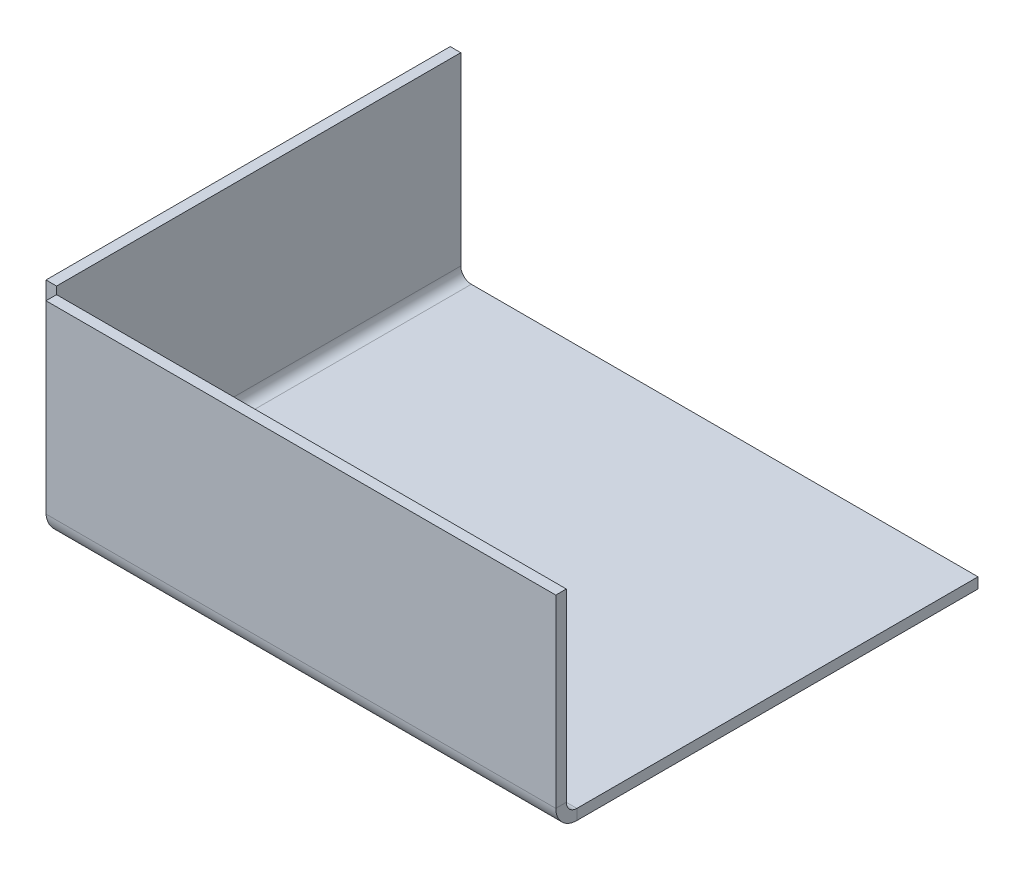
ISO-10303-21;
HEADER;
FILE_DESCRIPTION(('STEP AP214'),'2;1');
FILE_NAME('part.step','',(''),(''),'','','');
FILE_SCHEMA(('AUTOMOTIVE_DESIGN { 1 0 10303 214 1 1 1 1 }'));
ENDSEC;
DATA;
#1=APPLICATION_CONTEXT('core data for automotive mechanical design processes');
#2=APPLICATION_PROTOCOL_DEFINITION('international standard','automotive_design',2000,#1);
#3=PRODUCT_CONTEXT('',#1,'mechanical');
#4=PRODUCT('Part','Part','',(#3));
#5=PRODUCT_RELATED_PRODUCT_CATEGORY('part','',(#4));
#6=PRODUCT_DEFINITION_FORMATION('','',#4);
#7=PRODUCT_DEFINITION_CONTEXT('part definition',#1,'design');
#8=PRODUCT_DEFINITION('design','',#6,#7);
#9=PRODUCT_DEFINITION_SHAPE('','',#8);
#10=(LENGTH_UNIT() NAMED_UNIT(*) SI_UNIT(.MILLI.,.METRE.));
#11=(NAMED_UNIT(*) PLANE_ANGLE_UNIT() SI_UNIT($,.RADIAN.));
#12=(NAMED_UNIT(*) SI_UNIT($,.STERADIAN.) SOLID_ANGLE_UNIT());
#13=UNCERTAINTY_MEASURE_WITH_UNIT(LENGTH_MEASURE(1.E-05),#10,'distance_accuracy_value','');
#14=(GEOMETRIC_REPRESENTATION_CONTEXT(3) GLOBAL_UNCERTAINTY_ASSIGNED_CONTEXT((#13)) GLOBAL_UNIT_ASSIGNED_CONTEXT((#10,
#11,#12)) REPRESENTATION_CONTEXT('',''));
#15=CARTESIAN_POINT('',(0.,0.,0.));
#16=DIRECTION('',(0.,0.,1.));
#17=DIRECTION('',(1.,0.,0.));
#18=AXIS2_PLACEMENT_3D('',#15,#16,#17);
#19=CARTESIAN_POINT('',(0.,-2.,0.));
#20=DIRECTION('',(0.,-1.,0.));
#21=DIRECTION('',(0.,0.,-1.));
#22=AXIS2_PLACEMENT_3D('',#19,#20,#21);
#23=PLANE('',#22);
#24=DIRECTION('',(0.,0.,-1.));
#25=VECTOR('',#24,1.);
#26=CARTESIAN_POINT('',(50.,-2.,-40.));
#27=LINE('',#26,#25);
#28=CARTESIAN_POINT('',(50.,-2.00000000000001,36.));
#29=VERTEX_POINT('',#28);
#30=CARTESIAN_POINT('',(50.,-2.,-40.));
#31=VERTEX_POINT('',#30);
#32=EDGE_CURVE('E102',#29,#31,#27,.T.);
#33=ORIENTED_EDGE('',*,*,#32,.F.);
#34=DIRECTION('',(1.,0.,0.));
#35=VECTOR('',#34,1.);
#36=CARTESIAN_POINT('',(50.,-2.00000000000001,36.));
#37=LINE('',#36,#35);
#38=CARTESIAN_POINT('',(-46.,-2.,36.));
#39=VERTEX_POINT('',#38);
#40=EDGE_CURVE('E215',#29,#39,#37,.F.);
#41=ORIENTED_EDGE('',*,*,#40,.T.);
#42=DIRECTION('',(0.,0.,1.));
#43=VECTOR('',#42,1.);
#44=CARTESIAN_POINT('',(-46.,-2.,36.5857864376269));
#45=LINE('',#44,#43);
#46=CARTESIAN_POINT('',(-46.,-2.,-40.));
#47=VERTEX_POINT('',#46);
#48=EDGE_CURVE('E312',#39,#47,#45,.F.);
#49=ORIENTED_EDGE('',*,*,#48,.T.);
#50=DIRECTION('',(-1.,0.,0.));
#51=VECTOR('',#50,1.);
#52=CARTESIAN_POINT('',(50.,-2.,-40.));
#53=LINE('',#52,#51);
#54=EDGE_CURVE('E87',#31,#47,#53,.T.);
#55=ORIENTED_EDGE('',*,*,#54,.F.);
#56=EDGE_LOOP('',(#33,#41,#49,#55));
#57=FACE_BOUND('',#56,.T.);
#58=ADVANCED_FACE('F79',(#57),#23,.T.);
#59=CARTESIAN_POINT('',(0.,0.,0.));
#60=DIRECTION('',(0.,-1.,0.));
#61=DIRECTION('',(0.,0.,-1.));
#62=AXIS2_PLACEMENT_3D('',#59,#60,#61);
#63=PLANE('',#62);
#64=DIRECTION('',(1.,0.,0.));
#65=VECTOR('',#64,1.);
#66=CARTESIAN_POINT('',(50.,0.,36.));
#67=LINE('',#66,#65);
#68=CARTESIAN_POINT('',(50.,0.,36.));
#69=VERTEX_POINT('',#68);
#70=CARTESIAN_POINT('',(-46.,0.,36.));
#71=VERTEX_POINT('',#70);
#72=EDGE_CURVE('E220',#69,#71,#67,.F.);
#73=ORIENTED_EDGE('',*,*,#72,.F.);
#74=DIRECTION('',(0.,0.,-1.));
#75=VECTOR('',#74,1.);
#76=CARTESIAN_POINT('',(50.,0.,-40.));
#77=LINE('',#76,#75);
#78=CARTESIAN_POINT('',(50.,0.,-40.));
#79=VERTEX_POINT('',#78);
#80=EDGE_CURVE('E295',#69,#79,#77,.T.);
#81=ORIENTED_EDGE('',*,*,#80,.T.);
#82=DIRECTION('',(-1.,0.,0.));
#83=VECTOR('',#82,1.);
#84=CARTESIAN_POINT('',(50.,0.,-40.));
#85=LINE('',#84,#83);
#86=CARTESIAN_POINT('',(-46.,0.,-40.));
#87=VERTEX_POINT('',#86);
#88=EDGE_CURVE('E291',#79,#87,#85,.T.);
#89=ORIENTED_EDGE('',*,*,#88,.T.);
#90=DIRECTION('',(0.,0.,1.));
#91=VECTOR('',#90,1.);
#92=CARTESIAN_POINT('',(-46.,0.,36.5857864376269));
#93=LINE('',#92,#91);
#94=EDGE_CURVE('E302',#71,#87,#93,.F.);
#95=ORIENTED_EDGE('',*,*,#94,.F.);
#96=EDGE_LOOP('',(#73,#81,#89,#95));
#97=FACE_BOUND('',#96,.T.);
#98=ADVANCED_FACE('F263',(#97),#63,.F.);
#99=CARTESIAN_POINT('',(50.,-2.,-40.));
#100=DIRECTION('',(1.,0.,0.));
#101=DIRECTION('',(0.,0.,-1.));
#102=AXIS2_PLACEMENT_3D('',#99,#100,#101);
#103=PLANE('',#102);
#104=ORIENTED_EDGE('',*,*,#80,.F.);
#105=DIRECTION('',(0.,-1.,0.));
#106=VECTOR('',#105,1.);
#107=CARTESIAN_POINT('',(50.,0.,36.));
#108=LINE('',#107,#106);
#109=EDGE_CURVE('E225',#69,#29,#108,.T.);
#110=ORIENTED_EDGE('',*,*,#109,.T.);
#111=ORIENTED_EDGE('',*,*,#32,.T.);
#112=DIRECTION('',(0.,1.,0.));
#113=VECTOR('',#112,1.);
#114=CARTESIAN_POINT('',(50.,-2.,-40.));
#115=LINE('',#114,#113);
#116=EDGE_CURVE('E13',#31,#79,#115,.T.);
#117=ORIENTED_EDGE('',*,*,#116,.T.);
#118=EDGE_LOOP('',(#104,#110,#111,#117));
#119=FACE_BOUND('',#118,.T.);
#120=ADVANCED_FACE('F81',(#119),#103,.T.);
#121=CARTESIAN_POINT('',(50.,-2.,-40.));
#122=DIRECTION('',(0.,0.,-1.));
#123=DIRECTION('',(-1.,0.,0.));
#124=AXIS2_PLACEMENT_3D('',#121,#122,#123);
#125=PLANE('',#124);
#126=DIRECTION('',(0.,-1.,0.));
#127=VECTOR('',#126,1.);
#128=CARTESIAN_POINT('',(-46.,0.,-40.));
#129=LINE('',#128,#127);
#130=EDGE_CURVE('E289',#87,#47,#129,.T.);
#131=ORIENTED_EDGE('',*,*,#130,.F.);
#132=ORIENTED_EDGE('',*,*,#88,.F.);
#133=ORIENTED_EDGE('',*,*,#116,.F.);
#134=ORIENTED_EDGE('',*,*,#54,.T.);
#135=EDGE_LOOP('',(#131,#132,#133,#134));
#136=FACE_BOUND('',#135,.T.);
#137=ADVANCED_FACE('F277',(#136),#125,.T.);
#138=CARTESIAN_POINT('',(-46.,2.,-40.));
#139=DIRECTION('',(0.,0.,-1.));
#140=DIRECTION('',(-1.,0.,0.));
#141=AXIS2_PLACEMENT_3D('',#138,#139,#140);
#142=PLANE('',#141);
#143=DIRECTION('',(-1.,0.,0.));
#144=VECTOR('',#143,1.);
#145=CARTESIAN_POINT('',(-50.,1.99999999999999,-40.));
#146=LINE('',#145,#144);
#147=CARTESIAN_POINT('',(-48.,1.99999999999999,-40.));
#148=VERTEX_POINT('',#147);
#149=CARTESIAN_POINT('',(-50.,1.99999999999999,-40.));
#150=VERTEX_POINT('',#149);
#151=EDGE_CURVE('E342',#148,#150,#146,.T.);
#152=ORIENTED_EDGE('',*,*,#151,.F.);
#153=CARTESIAN_POINT('',(-46.,2.,-40.));
#154=DIRECTION('',(0.,0.,1.));
#155=DIRECTION('',(1.,0.,0.));
#156=AXIS2_PLACEMENT_3D('',#153,#154,#155);
#157=CIRCLE('',#156,2.);
#158=EDGE_CURVE('E313',#87,#148,#157,.F.);
#159=ORIENTED_EDGE('',*,*,#158,.F.);
#160=ORIENTED_EDGE('',*,*,#130,.T.);
#161=CARTESIAN_POINT('',(-46.,2.,-40.));
#162=DIRECTION('',(0.,0.,1.));
#163=DIRECTION('',(1.,0.,0.));
#164=AXIS2_PLACEMENT_3D('',#161,#162,#163);
#165=CIRCLE('',#164,4.);
#166=EDGE_CURVE('E94',#47,#150,#165,.F.);
#167=ORIENTED_EDGE('',*,*,#166,.T.);
#168=EDGE_LOOP('',(#152,#159,#160,#167));
#169=FACE_BOUND('',#168,.T.);
#170=ADVANCED_FACE('F279',(#169),#142,.T.);
#171=CARTESIAN_POINT('',(-50.02,1.99999999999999,36.5857864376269));
#172=CARTESIAN_POINT('',(-50.02,1.4736891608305,36.5369621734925));
#173=CARTESIAN_POINT('',(-49.9153701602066,0.947773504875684,36.4881553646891));
#174=CARTESIAN_POINT('',(-49.5126212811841,-0.0245483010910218,36.3905242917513));
#175=CARTESIAN_POINT('',(-49.2146607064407,-0.470477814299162,36.3417087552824));
#176=CARTESIAN_POINT('',(-48.4704778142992,-1.21466070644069,36.2440776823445));
#177=CARTESIAN_POINT('',(-48.024548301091,-1.51262128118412,36.1952621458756));
#178=CARTESIAN_POINT('',(-47.0522264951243,-1.91537016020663,36.0976310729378));
#179=CARTESIAN_POINT('',(-46.5263108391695,-2.02,36.0488242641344));
#180=CARTESIAN_POINT('',(-46.,-2.02,36.));
#181=CARTESIAN_POINT('',(-50.,1.99999999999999,36.5857864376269));
#182=CARTESIAN_POINT('',(-50.,1.47630763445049,36.5369621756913));
#183=CARTESIAN_POINT('',(-49.8958907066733,0.95300846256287,36.4881553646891));
#184=CARTESIAN_POINT('',(-49.495145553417,-0.0144759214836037,36.3905242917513));
#185=CARTESIAN_POINT('',(-49.1986673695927,-0.458186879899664,36.3417087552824));
#186=CARTESIAN_POINT('',(-48.4581868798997,-1.19866736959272,36.2440776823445));
#187=CARTESIAN_POINT('',(-48.0144759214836,-1.49514555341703,36.1952621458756));
#188=CARTESIAN_POINT('',(-47.0469915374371,-1.89589070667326,36.0976310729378));
#189=CARTESIAN_POINT('',(-46.5236923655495,-2.,36.0488242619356));
#190=CARTESIAN_POINT('',(-46.,-2.,36.));
#191=CARTESIAN_POINT('',(-48.,1.99999999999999,36.5857864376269));
#192=CARTESIAN_POINT('',(-48.,1.73815499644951,36.5369623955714));
#193=CARTESIAN_POINT('',(-47.9479453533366,1.47650423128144,36.4881553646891));
#194=CARTESIAN_POINT('',(-47.7475727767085,0.992762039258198,36.3905242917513));
#195=CARTESIAN_POINT('',(-47.5993336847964,0.770906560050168,36.3417087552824));
#196=CARTESIAN_POINT('',(-47.2290934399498,0.400666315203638,36.2440776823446));
#197=CARTESIAN_POINT('',(-47.0072379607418,0.252427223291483,36.1952621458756));
#198=CARTESIAN_POINT('',(-46.5234957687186,0.0520546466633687,36.0976310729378));
#199=CARTESIAN_POINT('',(-46.2618450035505,0.,36.0488240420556));
#200=CARTESIAN_POINT('',(-46.,0.,36.));
#201=CARTESIAN_POINT('',(-47.9798,1.99999999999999,36.5857864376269));
#202=CARTESIAN_POINT('',(-47.9798,1.7407996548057,36.5369623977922));
#203=CARTESIAN_POINT('',(-47.9282711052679,1.48179153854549,36.4881553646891));
#204=CARTESIAN_POINT('',(-47.7299222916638,1.00293514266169,36.3905242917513));
#205=CARTESIAN_POINT('',(-47.5831804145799,0.783320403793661,36.3417087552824));
#206=CARTESIAN_POINT('',(-47.2166795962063,0.416819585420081,36.2440776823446));
#207=CARTESIAN_POINT('',(-46.9970648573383,0.270077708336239,36.1952621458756));
#208=CARTESIAN_POINT('',(-46.5182084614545,0.0717288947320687,36.0976310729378));
#209=CARTESIAN_POINT('',(-46.2592003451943,0.0202,36.0488240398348));
#210=CARTESIAN_POINT('',(-46.,0.0202,36.));
#211=B_SPLINE_SURFACE_WITH_KNOTS('',1,3,((#171,#172,#173,#174,#175,#176,#177,#178,#179,#180),
(#181,#182,#183,#184,#185,#186,#187,#188,#189,#190),(#191,#192,#193,#194,#195,#196,#197,#198,
#199,#200),(#201,#202,#203,#204,#205,#206,#207,#208,#209,#210)),.UNSPECIFIED.,.F.,.F.,.F.,(2,1,
1,2),(4,2,2,2,4),(-0.01,0.,1.,1.0101),(0.,0.25,0.5,0.75,1.),.UNSPECIFIED.);
#212=CARTESIAN_POINT('',(-48.,1.99999999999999,36.5857864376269));
#213=CARTESIAN_POINT('',(-47.9999997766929,1.94274588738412,36.5751099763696));
#214=CARTESIAN_POINT('',(-47.9975399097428,1.88551913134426,36.564439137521));
#215=CARTESIAN_POINT('',(-47.9877275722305,1.77148947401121,36.5430984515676));
#216=CARTESIAN_POINT('',(-47.9803753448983,1.71468655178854,36.5324286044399));
#217=CARTESIAN_POINT('',(-47.9510523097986,1.54564618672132,36.5004390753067));
#218=CARTESIAN_POINT('',(-47.9218149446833,1.43458435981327,36.4791039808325));
#219=CARTESIAN_POINT('',(-47.8448016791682,1.21908758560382,36.4364321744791));
#220=CARTESIAN_POINT('',(-47.7970165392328,1.11465597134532,36.4150954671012));
#221=CARTESIAN_POINT('',(-47.684317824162,0.915493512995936,36.3724263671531));
#222=CARTESIAN_POINT('',(-47.6194076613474,0.820760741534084,36.3510939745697));
#223=CARTESIAN_POINT('',(-47.4743772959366,0.643791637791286,36.3084303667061));
#224=CARTESIAN_POINT('',(-47.3942596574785,0.561553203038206,36.2870991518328));
#225=CARTESIAN_POINT('',(-47.221132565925,0.411943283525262,36.2444334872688));
#226=CARTESIAN_POINT('',(-47.1281198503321,0.344575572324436,36.2230990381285));
#227=CARTESIAN_POINT('',(-46.9319428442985,0.226701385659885,36.1804248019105));
#228=CARTESIAN_POINT('',(-46.8287758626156,0.176199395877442,36.159085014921));
#229=CARTESIAN_POINT('',(-46.6153647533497,0.0935917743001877,36.1164137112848));
#230=CARTESIAN_POINT('',(-46.5051262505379,0.0614717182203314,36.0950822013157));
#231=CARTESIAN_POINT('',(-46.328324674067,0.0260260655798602,36.0614602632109));
#232=CARTESIAN_POINT('',(-46.2629872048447,0.0162684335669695,36.049157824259));
#233=CARTESIAN_POINT('',(-46.1317760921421,0.00325898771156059,36.0245724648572));
#234=CARTESIAN_POINT('',(-46.0659035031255,-3.46430469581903E-06,36.0122895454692));
#235=CARTESIAN_POINT('',(-46.,0.,36.));
#236=B_SPLINE_CURVE_WITH_KNOTS('',3,(#212,#213,#214,#215,#216,#217,#218,#219,#220,#221,#222,
#223,#224,#225,#226,#227,#228,#229,#230,#231,#232,#233,#234,#235),.UNSPECIFIED.,.F.,.F.,(4,2,2,
2,2,2,2,2,2,2,2,4),(0.,0.174615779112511,0.349222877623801,0.697856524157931,1.04666406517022,
1.39540215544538,1.74408149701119,2.09284921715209,2.44170962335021,2.79029590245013,
2.99160298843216,3.19258009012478),.UNSPECIFIED.);
#237=CARTESIAN_POINT('',(-48.,1.99999999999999,36.5857864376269));
#238=VERTEX_POINT('',#237);
#239=EDGE_CURVE('E314',#238,#71,#236,.T.);
#240=DIRECTION('',(-1.,0.,0.));
#241=VECTOR('',#240,1.);
#242=CARTESIAN_POINT('',(-48.,1.99999999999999,36.5857864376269));
#243=LINE('',#242,#241);
#244=CARTESIAN_POINT('',(-50.,1.99999999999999,36.5857864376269));
#245=VERTEX_POINT('',#244);
#246=EDGE_CURVE('E374',#245,#238,#243,.F.);
#247=CARTESIAN_POINT('',(-50.,1.99999999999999,36.5857864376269));
#248=CARTESIAN_POINT('',(-50.0000122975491,1.88700600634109,36.5752515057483));
#249=CARTESIAN_POINT('',(-49.9952126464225,1.77401378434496,36.5647167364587));
#250=CARTESIAN_POINT('',(-49.9760783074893,1.54884477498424,36.543648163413));
#251=CARTESIAN_POINT('',(-49.9617440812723,1.43666794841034,36.5331143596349));
#252=CARTESIAN_POINT('',(-49.9236438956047,1.21401502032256,36.5120553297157));
#253=CARTESIAN_POINT('',(-49.8998851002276,1.10353769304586,36.5015301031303));
#254=CARTESIAN_POINT('',(-49.8431103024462,0.884989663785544,36.4804788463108));
#255=CARTESIAN_POINT('',(-49.8100944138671,0.776918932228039,36.4699528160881));
#256=CARTESIAN_POINT('',(-49.7350282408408,0.563922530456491,36.4488973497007));
#257=CARTESIAN_POINT('',(-49.6929750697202,0.458997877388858,36.4383679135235));
#258=CARTESIAN_POINT('',(-49.6001273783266,0.253045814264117,36.4173051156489));
#259=CARTESIAN_POINT('',(-49.5493296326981,0.152019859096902,36.406771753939));
#260=CARTESIAN_POINT('',(-49.4393900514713,-0.0453214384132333,36.3857110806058));
#261=CARTESIAN_POINT('',(-49.3802528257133,-0.141639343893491,36.3751837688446));
#262=CARTESIAN_POINT('',(-49.2540442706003,-0.32894250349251,36.3541280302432));
#263=CARTESIAN_POINT('',(-49.1869700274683,-0.419925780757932,36.34359960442));
#264=CARTESIAN_POINT('',(-48.9745776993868,-0.683792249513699,36.3120198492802));
#265=CARTESIAN_POINT('',(-48.8179688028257,-0.847809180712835,36.2909511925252));
#266=CARTESIAN_POINT('',(-48.4793794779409,-1.14703036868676,36.2488231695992));
#267=CARTESIAN_POINT('',(-48.2973937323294,-1.2822285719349,36.2277638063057));
#268=CARTESIAN_POINT('',(-47.9131900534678,-1.52004929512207,36.1856379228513));
#269=CARTESIAN_POINT('',(-47.710967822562,-1.62266487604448,36.1645714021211));
#270=CARTESIAN_POINT('',(-47.2921674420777,-1.79226456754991,36.1224448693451));
#271=CARTESIAN_POINT('',(-47.0755984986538,-1.85927128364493,36.1013848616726));
#272=CARTESIAN_POINT('',(-46.7146415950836,-1.93827377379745,36.0669366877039));
#273=CARTESIAN_POINT('',(-46.5725955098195,-1.96140959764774,36.0535392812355));
#274=CARTESIAN_POINT('',(-46.2870530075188,-1.99226907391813,36.0267636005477));
#275=CARTESIAN_POINT('',(-46.1435590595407,-2.00001557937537,36.0133853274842));
#276=CARTESIAN_POINT('',(-46.,-2.,36.));
#277=B_SPLINE_CURVE_WITH_KNOTS('',3,(#247,#248,#249,#250,#251,#252,#253,#254,#255,#256,#257,
#258,#259,#260,#261,#262,#263,#264,#265,#266,#267,#268,#269,#270,#271,#272,#273,#274,#275,#276),
.UNSPECIFIED.,.F.,.F.,(4,2,2,2,2,2,2,2,2,2,2,2,2,2,4),(0.,0.340348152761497,0.680679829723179,
1.02075329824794,1.36082258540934,1.7010006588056,2.04130447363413,2.38142090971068,
2.7216625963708,3.40140632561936,4.0812926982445,4.76132376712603,5.44092261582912,
5.87377516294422,6.30598444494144),.UNSPECIFIED.);
#278=EDGE_CURVE('E305',#245,#39,#277,.T.);
#279=DIRECTION('',(0.,-1.,0.));
#280=VECTOR('',#279,1.);
#281=CARTESIAN_POINT('',(-46.,0.,36.));
#282=LINE('',#281,#280);
#283=EDGE_CURVE('E296',#71,#39,#282,.T.);
#284=ORIENTED_EDGE('',*,*,#239,.F.);
#285=ORIENTED_EDGE('',*,*,#246,.F.);
#286=ORIENTED_EDGE('',*,*,#278,.T.);
#287=ORIENTED_EDGE('',*,*,#283,.F.);
#288=EDGE_LOOP('',(#284,#285,#286,#287));
#289=FACE_BOUND('',#288,.T.);
#290=ADVANCED_FACE('F272',(#289),#211,.F.);
#291=CARTESIAN_POINT('',(-46.,2.,36.5857864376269));
#292=DIRECTION('',(0.,0.,1.));
#293=DIRECTION('',(-1.,0.,0.));
#294=AXIS2_PLACEMENT_3D('',#291,#292,#293);
#295=CYLINDRICAL_SURFACE('',#294,4.);
#296=ORIENTED_EDGE('',*,*,#48,.F.);
#297=ORIENTED_EDGE('',*,*,#278,.F.);
#298=DIRECTION('',(0.,0.,1.));
#299=VECTOR('',#298,1.);
#300=CARTESIAN_POINT('',(-50.,1.99999999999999,0.));
#301=LINE('',#300,#299);
#302=EDGE_CURVE('E359',#150,#245,#301,.T.);
#303=ORIENTED_EDGE('',*,*,#302,.F.);
#304=ORIENTED_EDGE('',*,*,#166,.F.);
#305=EDGE_LOOP('',(#296,#297,#303,#304));
#306=FACE_BOUND('',#305,.T.);
#307=ADVANCED_FACE('F320',(#306),#295,.T.);
#308=CARTESIAN_POINT('',(-46.,2.,36.5857864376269));
#309=DIRECTION('',(0.,0.,1.));
#310=DIRECTION('',(-1.,0.,0.));
#311=AXIS2_PLACEMENT_3D('',#308,#309,#310);
#312=CYLINDRICAL_SURFACE('',#311,2.);
#313=ORIENTED_EDGE('',*,*,#94,.T.);
#314=ORIENTED_EDGE('',*,*,#158,.T.);
#315=DIRECTION('',(0.,0.,-1.));
#316=VECTOR('',#315,1.);
#317=CARTESIAN_POINT('',(-48.,1.99999999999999,-40.));
#318=LINE('',#317,#316);
#319=EDGE_CURVE('E357',#148,#238,#318,.F.);
#320=ORIENTED_EDGE('',*,*,#319,.T.);
#321=ORIENTED_EDGE('',*,*,#239,.T.);
#322=EDGE_LOOP('',(#313,#314,#320,#321));
#323=FACE_BOUND('',#322,.T.);
#324=ADVANCED_FACE('F324',(#323),#312,.F.);
#325=CARTESIAN_POINT('',(-50.0000000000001,37.,-40.));
#326=DIRECTION('',(0.,0.,-1.));
#327=DIRECTION('',(-1.,0.,0.));
#328=AXIS2_PLACEMENT_3D('',#325,#326,#327);
#329=PLANE('',#328);
#330=DIRECTION('',(0.,-1.,0.));
#331=VECTOR('',#330,1.);
#332=CARTESIAN_POINT('',(-48.,-1.78160789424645E-13,-40.));
#333=LINE('',#332,#331);
#334=CARTESIAN_POINT('',(-48.0000000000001,37.,-40.));
#335=VERTEX_POINT('',#334);
#336=EDGE_CURVE('E362',#148,#335,#333,.F.);
#337=ORIENTED_EDGE('',*,*,#336,.F.);
#338=ORIENTED_EDGE('',*,*,#151,.T.);
#339=DIRECTION('',(0.,1.,0.));
#340=VECTOR('',#339,1.);
#341=CARTESIAN_POINT('',(-50.0000000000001,37.,-40.));
#342=LINE('',#341,#340);
#343=CARTESIAN_POINT('',(-50.0000000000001,37.,-40.));
#344=VERTEX_POINT('',#343);
#345=EDGE_CURVE('E367',#150,#344,#342,.T.);
#346=ORIENTED_EDGE('',*,*,#345,.T.);
#347=DIRECTION('',(1.,0.,0.));
#348=VECTOR('',#347,1.);
#349=CARTESIAN_POINT('',(-50.0000000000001,37.,-40.));
#350=LINE('',#349,#348);
#351=EDGE_CURVE('E372',#344,#335,#350,.T.);
#352=ORIENTED_EDGE('',*,*,#351,.T.);
#353=EDGE_LOOP('',(#337,#338,#346,#352));
#354=FACE_BOUND('',#353,.T.);
#355=ADVANCED_FACE('F325',(#354),#329,.T.);
#356=CARTESIAN_POINT('',(-50.,-1.85143752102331E-13,0.));
#357=DIRECTION('',(-1.,0.,0.));
#358=DIRECTION('',(0.,-1.,0.));
#359=AXIS2_PLACEMENT_3D('',#356,#357,#358);
#360=PLANE('',#359);
#361=DIRECTION('',(0.,1.,0.));
#362=VECTOR('',#361,1.);
#363=CARTESIAN_POINT('',(-50.,0.,36.5857864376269));
#364=LINE('',#363,#362);
#365=CARTESIAN_POINT('',(-50.0000000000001,37.,36.5857864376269));
#366=VERTEX_POINT('',#365);
#367=EDGE_CURVE('E350',#366,#245,#364,.F.);
#368=ORIENTED_EDGE('',*,*,#367,.F.);
#369=DIRECTION('',(0.,0.,1.));
#370=VECTOR('',#369,1.);
#371=CARTESIAN_POINT('',(-50.0000000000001,37.,40.));
#372=LINE('',#371,#370);
#373=EDGE_CURVE('E369',#344,#366,#372,.T.);
#374=ORIENTED_EDGE('',*,*,#373,.F.);
#375=ORIENTED_EDGE('',*,*,#345,.F.);
#376=ORIENTED_EDGE('',*,*,#302,.T.);
#377=EDGE_LOOP('',(#368,#374,#375,#376));
#378=FACE_BOUND('',#377,.T.);
#379=ADVANCED_FACE('F333',(#378),#360,.T.);
#380=CARTESIAN_POINT('',(-48.,-1.78160789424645E-13,0.));
#381=DIRECTION('',(-1.,0.,0.));
#382=DIRECTION('',(0.,-1.,0.));
#383=AXIS2_PLACEMENT_3D('',#380,#381,#382);
#384=PLANE('',#383);
#385=DIRECTION('',(0.,0.,-1.));
#386=VECTOR('',#385,1.);
#387=CARTESIAN_POINT('',(-48.0000000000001,37.,0.));
#388=LINE('',#387,#386);
#389=CARTESIAN_POINT('',(-48.0000000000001,37.,36.5857864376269));
#390=VERTEX_POINT('',#389);
#391=EDGE_CURVE('E364',#335,#390,#388,.F.);
#392=ORIENTED_EDGE('',*,*,#391,.T.);
#393=DIRECTION('',(0.,1.,0.));
#394=VECTOR('',#393,1.);
#395=CARTESIAN_POINT('',(-48.,0.,36.5857864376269));
#396=LINE('',#395,#394);
#397=EDGE_CURVE('E227',#238,#390,#396,.T.);
#398=ORIENTED_EDGE('',*,*,#397,.F.);
#399=ORIENTED_EDGE('',*,*,#319,.F.);
#400=ORIENTED_EDGE('',*,*,#336,.T.);
#401=EDGE_LOOP('',(#392,#398,#399,#400));
#402=FACE_BOUND('',#401,.T.);
#403=ADVANCED_FACE('F389',(#402),#384,.F.);
#404=CARTESIAN_POINT('',(-50.0000000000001,37.,40.));
#405=DIRECTION('',(0.,1.,0.));
#406=DIRECTION('',(-1.,0.,0.));
#407=AXIS2_PLACEMENT_3D('',#404,#405,#406);
#408=PLANE('',#407);
#409=DIRECTION('',(1.,0.,0.));
#410=VECTOR('',#409,1.);
#411=CARTESIAN_POINT('',(-48.0000000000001,37.,36.5857864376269));
#412=LINE('',#411,#410);
#413=EDGE_CURVE('E353',#390,#366,#412,.F.);
#414=ORIENTED_EDGE('',*,*,#413,.F.);
#415=ORIENTED_EDGE('',*,*,#391,.F.);
#416=ORIENTED_EDGE('',*,*,#351,.F.);
#417=ORIENTED_EDGE('',*,*,#373,.T.);
#418=EDGE_LOOP('',(#414,#415,#416,#417));
#419=FACE_BOUND('',#418,.T.);
#420=ADVANCED_FACE('F391',(#419),#408,.T.);
#421=CARTESIAN_POINT('',(-48.,0.,36.5857864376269));
#422=DIRECTION('',(0.,0.,-1.));
#423=DIRECTION('',(0.,1.,0.));
#424=AXIS2_PLACEMENT_3D('',#421,#422,#423);
#425=PLANE('',#424);
#426=ORIENTED_EDGE('',*,*,#397,.T.);
#427=ORIENTED_EDGE('',*,*,#413,.T.);
#428=ORIENTED_EDGE('',*,*,#367,.T.);
#429=ORIENTED_EDGE('',*,*,#246,.T.);
#430=EDGE_LOOP('',(#426,#427,#428,#429));
#431=FACE_BOUND('',#430,.T.);
#432=ADVANCED_FACE('F378',(#431),#425,.F.);
#433=CARTESIAN_POINT('',(-46.,-2.02000000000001,36.));
#434=CARTESIAN_POINT('',(-46.0488242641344,-2.02000000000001,36.5263108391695));
#435=CARTESIAN_POINT('',(-46.0976310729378,-1.91537016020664,37.0522264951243));
#436=CARTESIAN_POINT('',(-46.1952621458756,-1.51262128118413,38.024548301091));
#437=CARTESIAN_POINT('',(-46.2440776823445,-1.21466070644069,38.4704778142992));
#438=CARTESIAN_POINT('',(-46.3417087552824,-0.470477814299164,39.2146607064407));
#439=CARTESIAN_POINT('',(-46.3905242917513,-0.0245483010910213,39.5126212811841));
#440=CARTESIAN_POINT('',(-46.4881553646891,0.947773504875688,39.9153701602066));
#441=CARTESIAN_POINT('',(-46.5369621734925,1.47368916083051,40.02));
#442=CARTESIAN_POINT('',(-46.5857864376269,1.99999999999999,40.02));
#443=CARTESIAN_POINT('',(-46.,-2.00000000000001,36.));
#444=CARTESIAN_POINT('',(-46.0488242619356,-2.00000000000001,36.5236923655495));
#445=CARTESIAN_POINT('',(-46.0976310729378,-1.89589070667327,37.0469915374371));
#446=CARTESIAN_POINT('',(-46.1952621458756,-1.49514555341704,38.0144759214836));
#447=CARTESIAN_POINT('',(-46.2440776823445,-1.19866736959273,38.4581868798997));
#448=CARTESIAN_POINT('',(-46.3417087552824,-0.458186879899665,39.1986673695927));
#449=CARTESIAN_POINT('',(-46.3905242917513,-0.0144759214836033,39.495145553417));
#450=CARTESIAN_POINT('',(-46.4881553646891,0.953008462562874,39.8958907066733));
#451=CARTESIAN_POINT('',(-46.5369621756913,1.4763076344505,40.));
#452=CARTESIAN_POINT('',(-46.5857864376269,1.99999999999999,40.));
#453=CARTESIAN_POINT('',(-46.,0.,36.));
#454=CARTESIAN_POINT('',(-46.0488240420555,0.,36.2618450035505));
#455=CARTESIAN_POINT('',(-46.0976310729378,0.0520546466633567,36.5234957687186));
#456=CARTESIAN_POINT('',(-46.1952621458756,0.252427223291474,37.0072379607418));
#457=CARTESIAN_POINT('',(-46.2440776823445,0.40066631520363,37.2290934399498));
#458=CARTESIAN_POINT('',(-46.3417087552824,0.770906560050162,37.5993336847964));
#459=CARTESIAN_POINT('',(-46.3905242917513,0.992762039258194,37.7475727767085));
#460=CARTESIAN_POINT('',(-46.4881553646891,1.47650423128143,37.9479453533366));
#461=CARTESIAN_POINT('',(-46.5369623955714,1.73815499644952,38.));
#462=CARTESIAN_POINT('',(-46.5857864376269,1.99999999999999,38.));
#463=CARTESIAN_POINT('',(-46.,0.0201999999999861,36.));
#464=CARTESIAN_POINT('',(-46.0488240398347,0.020199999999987,36.2592003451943));
#465=CARTESIAN_POINT('',(-46.0976310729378,0.0717288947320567,36.5182084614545));
#466=CARTESIAN_POINT('',(-46.1952621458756,0.27007770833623,36.9970648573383));
#467=CARTESIAN_POINT('',(-46.2440776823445,0.416819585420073,37.2166795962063));
#468=CARTESIAN_POINT('',(-46.3417087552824,0.783320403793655,37.5831804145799));
#469=CARTESIAN_POINT('',(-46.3905242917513,1.00293514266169,37.7299222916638));
#470=CARTESIAN_POINT('',(-46.4881553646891,1.48179153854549,37.9282711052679));
#471=CARTESIAN_POINT('',(-46.5369623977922,1.74079965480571,37.9798));
#472=CARTESIAN_POINT('',(-46.5857864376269,1.99999999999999,37.9798));
#473=B_SPLINE_SURFACE_WITH_KNOTS('',1,3,((#433,#434,#435,#436,#437,#438,#439,#440,#441,#442),
(#443,#444,#445,#446,#447,#448,#449,#450,#451,#452),(#453,#454,#455,#456,#457,#458,#459,#460,
#461,#462),(#463,#464,#465,#466,#467,#468,#469,#470,#471,#472)),.UNSPECIFIED.,.F.,.F.,.F.,(2,1,
1,2),(4,2,2,2,4),(-0.01,0.,1.,1.0101),(0.,0.25,0.5,0.75,1.),.UNSPECIFIED.);
#474=DIRECTION('',(0.,0.,-1.));
#475=VECTOR('',#474,1.);
#476=CARTESIAN_POINT('',(-46.5857864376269,1.99999999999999,38.));
#477=LINE('',#476,#475);
#478=CARTESIAN_POINT('',(-46.5857864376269,1.99999999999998,40.));
#479=VERTEX_POINT('',#478);
#480=CARTESIAN_POINT('',(-46.5857864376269,1.99999999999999,38.));
#481=VERTEX_POINT('',#480);
#482=EDGE_CURVE('E189',#479,#481,#477,.T.);
#483=CARTESIAN_POINT('',(-46.,0.,36.));
#484=CARTESIAN_POINT('',(-46.0106764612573,2.23307073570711E-07,36.0572541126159));
#485=CARTESIAN_POINT('',(-46.0213473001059,0.00246009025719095,36.1144808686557));
#486=CARTESIAN_POINT('',(-46.0426879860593,0.0122724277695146,36.2285105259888));
#487=CARTESIAN_POINT('',(-46.0533578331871,0.0196246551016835,36.2853134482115));
#488=CARTESIAN_POINT('',(-46.0853473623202,0.0489476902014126,36.4543538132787));
#489=CARTESIAN_POINT('',(-46.1066824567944,0.0781850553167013,36.5654156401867));
#490=CARTESIAN_POINT('',(-46.1493542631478,0.155198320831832,36.7809124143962));
#491=CARTESIAN_POINT('',(-46.1706909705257,0.20298346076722,36.8853440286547));
#492=CARTESIAN_POINT('',(-46.2133600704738,0.315682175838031,37.0845064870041));
#493=CARTESIAN_POINT('',(-46.2346924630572,0.380592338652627,37.1792392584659));
#494=CARTESIAN_POINT('',(-46.2773560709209,0.525622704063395,37.3562083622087));
#495=CARTESIAN_POINT('',(-46.2986872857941,0.6057403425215,37.4384467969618));
#496=CARTESIAN_POINT('',(-46.3413529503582,0.778867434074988,37.5880567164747));
#497=CARTESIAN_POINT('',(-46.3626873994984,0.871880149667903,37.6554244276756));
#498=CARTESIAN_POINT('',(-46.4053616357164,1.06805715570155,37.7732986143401));
#499=CARTESIAN_POINT('',(-46.4267014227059,1.17122413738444,37.8238006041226));
#500=CARTESIAN_POINT('',(-46.4693727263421,1.38463524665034,37.9064082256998));
#501=CARTESIAN_POINT('',(-46.4907042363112,1.49487374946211,37.9385282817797));
#502=CARTESIAN_POINT('',(-46.524326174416,1.67167532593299,37.9739739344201));
#503=CARTESIAN_POINT('',(-46.536628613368,1.73701279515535,37.983731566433));
#504=CARTESIAN_POINT('',(-46.5612139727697,1.86822390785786,37.9967410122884));
#505=CARTESIAN_POINT('',(-46.5734968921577,1.93409649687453,38.0000034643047));
#506=CARTESIAN_POINT('',(-46.5857864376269,1.99999999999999,38.));
#507=B_SPLINE_CURVE_WITH_KNOTS('',3,(#483,#484,#485,#486,#487,#488,#489,#490,#491,#492,#493,
#494,#495,#496,#497,#498,#499,#500,#501,#502,#503,#504,#505,#506),.UNSPECIFIED.,.F.,.F.,(4,2,2,
2,2,2,2,2,2,2,2,4),(0.,0.174615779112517,0.3492228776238,0.697856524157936,1.04666406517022,
1.39540215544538,1.7440814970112,2.0928492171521,2.44170962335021,2.79029590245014,
2.99160298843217,3.19258009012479),.UNSPECIFIED.);
#508=EDGE_CURVE('E216',#71,#481,#507,.T.);
#509=CARTESIAN_POINT('',(-46.,-2.00000000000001,36.));
#510=CARTESIAN_POINT('',(-46.0105349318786,-2.00001229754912,36.1129939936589));
#511=CARTESIAN_POINT('',(-46.0210697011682,-1.99521264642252,36.225986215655));
#512=CARTESIAN_POINT('',(-46.0421382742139,-1.97607830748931,36.4511552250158));
#513=CARTESIAN_POINT('',(-46.052672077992,-1.96174408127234,36.5633320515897));
#514=CARTESIAN_POINT('',(-46.0737311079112,-1.92364389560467,36.7859849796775));
#515=CARTESIAN_POINT('',(-46.0842563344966,-1.89988510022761,36.8964623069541));
#516=CARTESIAN_POINT('',(-46.1053075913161,-1.84311030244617,37.1150103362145));
#517=CARTESIAN_POINT('',(-46.1158336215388,-1.8100944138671,37.223081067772));
#518=CARTESIAN_POINT('',(-46.1368890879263,-1.73502824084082,37.4360774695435));
#519=CARTESIAN_POINT('',(-46.1474185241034,-1.69297506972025,37.5410021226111));
#520=CARTESIAN_POINT('',(-46.168481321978,-1.6001273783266,37.7469541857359));
#521=CARTESIAN_POINT('',(-46.1790146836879,-1.54932963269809,37.8479801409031));
#522=CARTESIAN_POINT('',(-46.2000753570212,-1.43939005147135,38.0453214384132));
#523=CARTESIAN_POINT('',(-46.2106026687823,-1.38025282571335,38.1416393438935));
#524=CARTESIAN_POINT('',(-46.2316584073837,-1.25404427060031,38.3289425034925));
#525=CARTESIAN_POINT('',(-46.2421868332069,-1.18697002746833,38.4199257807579));
#526=CARTESIAN_POINT('',(-46.2737665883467,-0.974577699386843,38.6837922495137));
#527=CARTESIAN_POINT('',(-46.2948352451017,-0.817968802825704,38.8478091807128));
#528=CARTESIAN_POINT('',(-46.3369632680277,-0.479379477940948,39.1470303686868));
#529=CARTESIAN_POINT('',(-46.3580226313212,-0.297393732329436,39.2822285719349));
#530=CARTESIAN_POINT('',(-46.4001485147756,0.0868099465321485,39.5200492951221));
#531=CARTESIAN_POINT('',(-46.4212150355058,0.28903217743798,39.6226648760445));
#532=CARTESIAN_POINT('',(-46.4633415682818,0.707832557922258,39.7922645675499));
#533=CARTESIAN_POINT('',(-46.4844015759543,0.924401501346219,39.8592712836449));
#534=CARTESIAN_POINT('',(-46.518849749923,1.28535840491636,39.9382737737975));
#535=CARTESIAN_POINT('',(-46.5322471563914,1.42740449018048,39.9614095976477));
#536=CARTESIAN_POINT('',(-46.5590228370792,1.71294699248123,39.9922690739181));
#537=CARTESIAN_POINT('',(-46.5724011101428,1.85644094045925,40.0000155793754));
#538=CARTESIAN_POINT('',(-46.5857864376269,1.99999999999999,40.));
#539=B_SPLINE_CURVE_WITH_KNOTS('',3,(#509,#510,#511,#512,#513,#514,#515,#516,#517,#518,#519,
#520,#521,#522,#523,#524,#525,#526,#527,#528,#529,#530,#531,#532,#533,#534,#535,#536,#537,#538),
.UNSPECIFIED.,.F.,.F.,(4,2,2,2,2,2,2,2,2,2,2,2,2,2,4),(0.,0.340348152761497,0.680679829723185,
1.02075329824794,1.36082258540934,1.7010006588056,2.04130447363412,2.38142090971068,
2.72166259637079,3.40140632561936,4.0812926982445,4.76132376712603,5.44092261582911,
5.87377516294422,6.30598444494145),.UNSPECIFIED.);
#540=EDGE_CURVE('E224',#39,#479,#539,.T.);
#541=ORIENTED_EDGE('',*,*,#482,.T.);
#542=ORIENTED_EDGE('',*,*,#508,.F.);
#543=ORIENTED_EDGE('',*,*,#283,.T.);
#544=ORIENTED_EDGE('',*,*,#540,.T.);
#545=EDGE_LOOP('',(#541,#542,#543,#544));
#546=FACE_BOUND('',#545,.T.);
#547=ADVANCED_FACE('F240',(#546),#473,.F.);
#548=CARTESIAN_POINT('',(50.,1.99999999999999,36.));
#549=DIRECTION('',(-1.,0.,0.));
#550=DIRECTION('',(0.,0.,1.));
#551=AXIS2_PLACEMENT_3D('',#548,#549,#550);
#552=PLANE('',#551);
#553=CARTESIAN_POINT('',(50.,1.99999999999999,36.));
#554=DIRECTION('',(1.,0.,0.));
#555=DIRECTION('',(0.,0.,-1.));
#556=AXIS2_PLACEMENT_3D('',#553,#554,#555);
#557=CIRCLE('',#556,2.00000000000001);
#558=CARTESIAN_POINT('',(50.,1.99999999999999,38.));
#559=VERTEX_POINT('',#558);
#560=EDGE_CURVE('E217',#559,#69,#557,.T.);
#561=ORIENTED_EDGE('',*,*,#560,.F.);
#562=DIRECTION('',(0.,0.,1.));
#563=VECTOR('',#562,1.);
#564=CARTESIAN_POINT('',(50.,1.99999999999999,38.));
#565=LINE('',#564,#563);
#566=CARTESIAN_POINT('',(50.,1.99999999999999,40.));
#567=VERTEX_POINT('',#566);
#568=EDGE_CURVE('E201',#559,#567,#565,.T.);
#569=ORIENTED_EDGE('',*,*,#568,.T.);
#570=CARTESIAN_POINT('',(50.,1.99999999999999,36.));
#571=DIRECTION('',(1.,0.,0.));
#572=DIRECTION('',(0.,0.,-1.));
#573=AXIS2_PLACEMENT_3D('',#570,#571,#572);
#574=CIRCLE('',#573,4.00000000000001);
#575=EDGE_CURVE('E212',#567,#29,#574,.T.);
#576=ORIENTED_EDGE('',*,*,#575,.T.);
#577=ORIENTED_EDGE('',*,*,#109,.F.);
#578=EDGE_LOOP('',(#561,#569,#576,#577));
#579=FACE_BOUND('',#578,.T.);
#580=ADVANCED_FACE('F250',(#579),#552,.F.);
#581=CARTESIAN_POINT('',(50.,1.99999999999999,36.));
#582=DIRECTION('',(1.,0.,0.));
#583=DIRECTION('',(0.,0.,1.));
#584=AXIS2_PLACEMENT_3D('',#581,#582,#583);
#585=CYLINDRICAL_SURFACE('',#584,4.00000000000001);
#586=ORIENTED_EDGE('',*,*,#40,.F.);
#587=ORIENTED_EDGE('',*,*,#575,.F.);
#588=DIRECTION('',(1.,0.,0.));
#589=VECTOR('',#588,1.);
#590=CARTESIAN_POINT('',(-50.,1.99999999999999,40.));
#591=LINE('',#590,#589);
#592=EDGE_CURVE('E193',#567,#479,#591,.F.);
#593=ORIENTED_EDGE('',*,*,#592,.T.);
#594=ORIENTED_EDGE('',*,*,#540,.F.);
#595=EDGE_LOOP('',(#586,#587,#593,#594));
#596=FACE_BOUND('',#595,.T.);
#597=ADVANCED_FACE('F245',(#596),#585,.T.);
#598=CARTESIAN_POINT('',(50.,1.99999999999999,36.));
#599=DIRECTION('',(1.,0.,0.));
#600=DIRECTION('',(0.,0.,1.));
#601=AXIS2_PLACEMENT_3D('',#598,#599,#600);
#602=CYLINDRICAL_SURFACE('',#601,2.00000000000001);
#603=ORIENTED_EDGE('',*,*,#72,.T.);
#604=ORIENTED_EDGE('',*,*,#508,.T.);
#605=DIRECTION('',(1.,0.,0.));
#606=VECTOR('',#605,1.);
#607=CARTESIAN_POINT('',(-50.,1.99999999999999,38.));
#608=LINE('',#607,#606);
#609=EDGE_CURVE('E204',#481,#559,#608,.T.);
#610=ORIENTED_EDGE('',*,*,#609,.T.);
#611=ORIENTED_EDGE('',*,*,#560,.T.);
#612=EDGE_LOOP('',(#603,#604,#610,#611));
#613=FACE_BOUND('',#612,.T.);
#614=ADVANCED_FACE('F249',(#613),#602,.F.);
#615=CARTESIAN_POINT('',(-46.5857864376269,0.,38.));
#616=DIRECTION('',(-1.,0.,0.));
#617=DIRECTION('',(0.,0.,1.));
#618=AXIS2_PLACEMENT_3D('',#615,#616,#617);
#619=PLANE('',#618);
#620=DIRECTION('',(0.,0.,1.));
#621=VECTOR('',#620,1.);
#622=CARTESIAN_POINT('',(-46.5857864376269,37.,40.0000000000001));
#623=LINE('',#622,#621);
#624=CARTESIAN_POINT('',(-46.5857864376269,37.,38.0000000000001));
#625=VERTEX_POINT('',#624);
#626=CARTESIAN_POINT('',(-46.5857864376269,37.,40.0000000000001));
#627=VERTEX_POINT('',#626);
#628=EDGE_CURVE('E177',#625,#627,#623,.T.);
#629=ORIENTED_EDGE('',*,*,#628,.F.);
#630=DIRECTION('',(0.,1.,0.));
#631=VECTOR('',#630,1.);
#632=CARTESIAN_POINT('',(-46.5857864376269,-1.42528631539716E-13,38.));
#633=LINE('',#632,#631);
#634=EDGE_CURVE('E209',#481,#625,#633,.T.);
#635=ORIENTED_EDGE('',*,*,#634,.F.);
#636=ORIENTED_EDGE('',*,*,#482,.F.);
#637=DIRECTION('',(0.,-1.,0.));
#638=VECTOR('',#637,1.);
#639=CARTESIAN_POINT('',(-46.5857864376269,0.,40.));
#640=LINE('',#639,#638);
#641=EDGE_CURVE('E207',#479,#627,#640,.F.);
#642=ORIENTED_EDGE('',*,*,#641,.T.);
#643=EDGE_LOOP('',(#629,#635,#636,#642));
#644=FACE_BOUND('',#643,.T.);
#645=ADVANCED_FACE('F255',(#644),#619,.T.);
#646=CARTESIAN_POINT('',(0.,-1.49511594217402E-13,40.));
#647=DIRECTION('',(0.,0.,-1.));
#648=DIRECTION('',(0.,1.,0.));
#649=AXIS2_PLACEMENT_3D('',#646,#647,#648);
#650=PLANE('',#649);
#651=ORIENTED_EDGE('',*,*,#641,.F.);
#652=ORIENTED_EDGE('',*,*,#592,.F.);
#653=DIRECTION('',(0.,1.,0.));
#654=VECTOR('',#653,1.);
#655=CARTESIAN_POINT('',(50.,37.,40.0000000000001));
#656=LINE('',#655,#654);
#657=CARTESIAN_POINT('',(50.,37.,40.0000000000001));
#658=VERTEX_POINT('',#657);
#659=EDGE_CURVE('E181',#658,#567,#656,.F.);
#660=ORIENTED_EDGE('',*,*,#659,.F.);
#661=DIRECTION('',(-1.,0.,0.));
#662=VECTOR('',#661,1.);
#663=CARTESIAN_POINT('',(-50.,37.,40.0000000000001));
#664=LINE('',#663,#662);
#665=EDGE_CURVE('E171',#627,#658,#664,.F.);
#666=ORIENTED_EDGE('',*,*,#665,.F.);
#667=EDGE_LOOP('',(#651,#652,#660,#666));
#668=FACE_BOUND('',#667,.T.);
#669=ADVANCED_FACE('F192',(#668),#650,.F.);
#670=CARTESIAN_POINT('',(0.,-1.42528631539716E-13,38.));
#671=DIRECTION('',(0.,0.,-1.));
#672=DIRECTION('',(0.,1.,0.));
#673=AXIS2_PLACEMENT_3D('',#670,#671,#672);
#674=PLANE('',#673);
#675=ORIENTED_EDGE('',*,*,#609,.F.);
#676=ORIENTED_EDGE('',*,*,#634,.T.);
#677=DIRECTION('',(1.,0.,0.));
#678=VECTOR('',#677,1.);
#679=CARTESIAN_POINT('',(0.,37.,38.0000000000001));
#680=LINE('',#679,#678);
#681=CARTESIAN_POINT('',(50.,37.,38.0000000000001));
#682=VERTEX_POINT('',#681);
#683=EDGE_CURVE('E198',#625,#682,#680,.T.);
#684=ORIENTED_EDGE('',*,*,#683,.T.);
#685=DIRECTION('',(0.,-1.,0.));
#686=VECTOR('',#685,1.);
#687=CARTESIAN_POINT('',(50.,-1.42528631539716E-13,38.));
#688=LINE('',#687,#686);
#689=EDGE_CURVE('E182',#682,#559,#688,.T.);
#690=ORIENTED_EDGE('',*,*,#689,.T.);
#691=EDGE_LOOP('',(#675,#676,#684,#690));
#692=FACE_BOUND('',#691,.T.);
#693=ADVANCED_FACE('F410',(#692),#674,.T.);
#694=CARTESIAN_POINT('',(-50.,37.,40.0000000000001));
#695=DIRECTION('',(0.,1.,0.));
#696=DIRECTION('',(0.,0.,1.));
#697=AXIS2_PLACEMENT_3D('',#694,#695,#696);
#698=PLANE('',#697);
#699=ORIENTED_EDGE('',*,*,#683,.F.);
#700=ORIENTED_EDGE('',*,*,#628,.T.);
#701=ORIENTED_EDGE('',*,*,#665,.T.);
#702=DIRECTION('',(0.,0.,-1.));
#703=VECTOR('',#702,1.);
#704=CARTESIAN_POINT('',(50.,37.,40.0000000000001));
#705=LINE('',#704,#703);
#706=EDGE_CURVE('E175',#658,#682,#705,.T.);
#707=ORIENTED_EDGE('',*,*,#706,.T.);
#708=EDGE_LOOP('',(#699,#700,#701,#707));
#709=FACE_BOUND('',#708,.T.);
#710=ADVANCED_FACE('F174',(#709),#698,.T.);
#711=CARTESIAN_POINT('',(50.,37.,40.0000000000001));
#712=DIRECTION('',(1.,0.,0.));
#713=DIRECTION('',(0.,0.,-1.));
#714=AXIS2_PLACEMENT_3D('',#711,#712,#713);
#715=PLANE('',#714);
#716=ORIENTED_EDGE('',*,*,#659,.T.);
#717=ORIENTED_EDGE('',*,*,#568,.F.);
#718=ORIENTED_EDGE('',*,*,#689,.F.);
#719=ORIENTED_EDGE('',*,*,#706,.F.);
#720=EDGE_LOOP('',(#716,#717,#718,#719));
#721=FACE_BOUND('',#720,.T.);
#722=ADVANCED_FACE('F186',(#721),#715,.T.);
#723=CLOSED_SHELL('',(#58,#98,#120,#137,#170,#290,#307,#324,#355,#379,#403,#420,#432,#547,#580,
#597,#614,#645,#669,#693,#710,#722));
#724=MANIFOLD_SOLID_BREP('B2',#723);
#725=ADVANCED_BREP_SHAPE_REPRESENTATION('',(#18,#724),#14);
#726=SHAPE_DEFINITION_REPRESENTATION(#9,#725);
ENDSEC;
END-ISO-10303-21;
